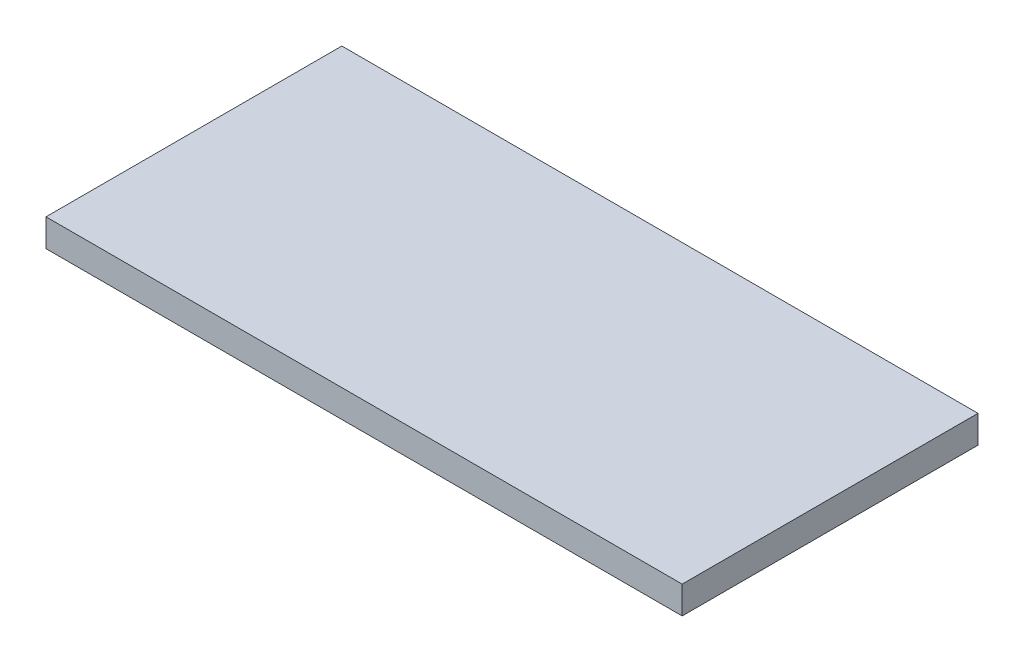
ISO-10303-21;
HEADER;
FILE_DESCRIPTION(('STEP AP214'),'2;1');
FILE_NAME('part.step','',(''),(''),'','','');
FILE_SCHEMA(('AUTOMOTIVE_DESIGN { 1 0 10303 214 1 1 1 1 }'));
ENDSEC;
DATA;
#1=APPLICATION_CONTEXT('core data for automotive mechanical design processes');
#2=APPLICATION_PROTOCOL_DEFINITION('international standard','automotive_design',2000,#1);
#3=PRODUCT_CONTEXT('',#1,'mechanical');
#4=PRODUCT('Part','Part','',(#3));
#5=PRODUCT_RELATED_PRODUCT_CATEGORY('part','',(#4));
#6=PRODUCT_DEFINITION_FORMATION('','',#4);
#7=PRODUCT_DEFINITION_CONTEXT('part definition',#1,'design');
#8=PRODUCT_DEFINITION('design','',#6,#7);
#9=PRODUCT_DEFINITION_SHAPE('','',#8);
#10=(LENGTH_UNIT() NAMED_UNIT(*) SI_UNIT(.MILLI.,.METRE.));
#11=(NAMED_UNIT(*) PLANE_ANGLE_UNIT() SI_UNIT($,.RADIAN.));
#12=(NAMED_UNIT(*) SI_UNIT($,.STERADIAN.) SOLID_ANGLE_UNIT());
#13=UNCERTAINTY_MEASURE_WITH_UNIT(LENGTH_MEASURE(1.E-05),#10,'distance_accuracy_value','');
#14=(GEOMETRIC_REPRESENTATION_CONTEXT(3) GLOBAL_UNCERTAINTY_ASSIGNED_CONTEXT((#13)) GLOBAL_UNIT_ASSIGNED_CONTEXT((#10,
#11,#12)) REPRESENTATION_CONTEXT('',''));
#15=CARTESIAN_POINT('',(0.,0.,0.));
#16=DIRECTION('',(0.,0.,1.));
#17=DIRECTION('',(1.,0.,0.));
#18=AXIS2_PLACEMENT_3D('',#15,#16,#17);
#19=CARTESIAN_POINT('',(-34.56399697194,3.,-16.0727414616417));
#20=DIRECTION('',(1.,0.,0.));
#21=DIRECTION('',(0.,0.,-1.));
#22=AXIS2_PLACEMENT_3D('',#19,#20,#21);
#23=PLANE('',#22);
#24=DIRECTION('',(0.,0.,1.));
#25=VECTOR('',#24,1.);
#26=CARTESIAN_POINT('',(-34.56399697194,0.,-16.0727414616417));
#27=LINE('',#26,#25);
#28=CARTESIAN_POINT('',(-34.56399697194,0.,-16.0727414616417));
#29=VERTEX_POINT('',#28);
#30=CARTESIAN_POINT('',(-34.56399697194,0.,16.0727414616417));
#31=VERTEX_POINT('',#30);
#32=EDGE_CURVE('E96',#29,#31,#27,.T.);
#33=ORIENTED_EDGE('',*,*,#32,.T.);
#34=DIRECTION('',(0.,-1.,0.));
#35=VECTOR('',#34,1.);
#36=CARTESIAN_POINT('',(-34.56399697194,3.,16.0727414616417));
#37=LINE('',#36,#35);
#38=CARTESIAN_POINT('',(-34.56399697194,3.,16.0727414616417));
#39=VERTEX_POINT('',#38);
#40=EDGE_CURVE('E11',#39,#31,#37,.T.);
#41=ORIENTED_EDGE('',*,*,#40,.F.);
#42=DIRECTION('',(0.,0.,1.));
#43=VECTOR('',#42,1.);
#44=CARTESIAN_POINT('',(-34.56399697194,3.,-16.0727414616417));
#45=LINE('',#44,#43);
#46=CARTESIAN_POINT('',(-34.56399697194,3.,-16.0727414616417));
#47=VERTEX_POINT('',#46);
#48=EDGE_CURVE('E84',#47,#39,#45,.T.);
#49=ORIENTED_EDGE('',*,*,#48,.F.);
#50=DIRECTION('',(0.,-1.,0.));
#51=VECTOR('',#50,1.);
#52=CARTESIAN_POINT('',(-34.56399697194,3.,-16.0727414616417));
#53=LINE('',#52,#51);
#54=EDGE_CURVE('E92',#47,#29,#53,.T.);
#55=ORIENTED_EDGE('',*,*,#54,.T.);
#56=EDGE_LOOP('',(#33,#41,#49,#55));
#57=FACE_BOUND('',#56,.T.);
#58=ADVANCED_FACE('F33',(#57),#23,.F.);
#59=CARTESIAN_POINT('',(-34.56399697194,3.,16.0727414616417));
#60=DIRECTION('',(0.,0.,-1.));
#61=DIRECTION('',(-1.,0.,0.));
#62=AXIS2_PLACEMENT_3D('',#59,#60,#61);
#63=PLANE('',#62);
#64=DIRECTION('',(1.,0.,0.));
#65=VECTOR('',#64,1.);
#66=CARTESIAN_POINT('',(-34.56399697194,0.,16.0727414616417));
#67=LINE('',#66,#65);
#68=CARTESIAN_POINT('',(34.56399697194,0.,16.0727414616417));
#69=VERTEX_POINT('',#68);
#70=EDGE_CURVE('E88',#31,#69,#67,.T.);
#71=ORIENTED_EDGE('',*,*,#70,.T.);
#72=DIRECTION('',(0.,-1.,0.));
#73=VECTOR('',#72,1.);
#74=CARTESIAN_POINT('',(34.56399697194,3.,16.0727414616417));
#75=LINE('',#74,#73);
#76=CARTESIAN_POINT('',(34.56399697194,3.,16.0727414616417));
#77=VERTEX_POINT('',#76);
#78=EDGE_CURVE('E41',#77,#69,#75,.T.);
#79=ORIENTED_EDGE('',*,*,#78,.F.);
#80=DIRECTION('',(1.,0.,0.));
#81=VECTOR('',#80,1.);
#82=CARTESIAN_POINT('',(-34.56399697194,3.,16.0727414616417));
#83=LINE('',#82,#81);
#84=EDGE_CURVE('E79',#39,#77,#83,.T.);
#85=ORIENTED_EDGE('',*,*,#84,.F.);
#86=ORIENTED_EDGE('',*,*,#40,.T.);
#87=EDGE_LOOP('',(#71,#79,#85,#86));
#88=FACE_BOUND('',#87,.T.);
#89=ADVANCED_FACE('F87',(#88),#63,.F.);
#90=CARTESIAN_POINT('',(34.56399697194,3.,-16.0727414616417));
#91=DIRECTION('',(-1.,0.,0.));
#92=DIRECTION('',(0.,0.,1.));
#93=AXIS2_PLACEMENT_3D('',#90,#91,#92);
#94=PLANE('',#93);
#95=DIRECTION('',(0.,0.,-1.));
#96=VECTOR('',#95,1.);
#97=CARTESIAN_POINT('',(34.56399697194,0.,-16.0727414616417));
#98=LINE('',#97,#96);
#99=CARTESIAN_POINT('',(34.56399697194,0.,-16.0727414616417));
#100=VERTEX_POINT('',#99);
#101=EDGE_CURVE('E66',#69,#100,#98,.T.);
#102=ORIENTED_EDGE('',*,*,#101,.T.);
#103=DIRECTION('',(0.,-1.,0.));
#104=VECTOR('',#103,1.);
#105=CARTESIAN_POINT('',(34.56399697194,3.,-16.0727414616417));
#106=LINE('',#105,#104);
#107=CARTESIAN_POINT('',(34.56399697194,3.,-16.0727414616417));
#108=VERTEX_POINT('',#107);
#109=EDGE_CURVE('E89',#108,#100,#106,.T.);
#110=ORIENTED_EDGE('',*,*,#109,.F.);
#111=DIRECTION('',(0.,0.,-1.));
#112=VECTOR('',#111,1.);
#113=CARTESIAN_POINT('',(34.56399697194,3.,-16.0727414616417));
#114=LINE('',#113,#112);
#115=EDGE_CURVE('E82',#77,#108,#114,.T.);
#116=ORIENTED_EDGE('',*,*,#115,.F.);
#117=ORIENTED_EDGE('',*,*,#78,.T.);
#118=EDGE_LOOP('',(#102,#110,#116,#117));
#119=FACE_BOUND('',#118,.T.);
#120=ADVANCED_FACE('F90',(#119),#94,.F.);
#121=CARTESIAN_POINT('',(-34.56399697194,3.,-16.0727414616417));
#122=DIRECTION('',(0.,0.,1.));
#123=DIRECTION('',(1.,0.,0.));
#124=AXIS2_PLACEMENT_3D('',#121,#122,#123);
#125=PLANE('',#124);
#126=DIRECTION('',(-1.,0.,0.));
#127=VECTOR('',#126,1.);
#128=CARTESIAN_POINT('',(-34.56399697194,0.,-16.0727414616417));
#129=LINE('',#128,#127);
#130=EDGE_CURVE('E72',#100,#29,#129,.T.);
#131=ORIENTED_EDGE('',*,*,#130,.T.);
#132=ORIENTED_EDGE('',*,*,#54,.F.);
#133=DIRECTION('',(-1.,0.,0.));
#134=VECTOR('',#133,1.);
#135=CARTESIAN_POINT('',(-34.56399697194,3.,-16.0727414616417));
#136=LINE('',#135,#134);
#137=EDGE_CURVE('E49',#108,#47,#136,.T.);
#138=ORIENTED_EDGE('',*,*,#137,.F.);
#139=ORIENTED_EDGE('',*,*,#109,.T.);
#140=EDGE_LOOP('',(#131,#132,#138,#139));
#141=FACE_BOUND('',#140,.T.);
#142=ADVANCED_FACE('F103',(#141),#125,.F.);
#143=CARTESIAN_POINT('',(-34.56399697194,3.,16.0727414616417));
#144=DIRECTION('',(0.,1.,0.));
#145=DIRECTION('',(0.,0.,1.));
#146=AXIS2_PLACEMENT_3D('',#143,#144,#145);
#147=PLANE('',#146);
#148=ORIENTED_EDGE('',*,*,#48,.T.);
#149=ORIENTED_EDGE('',*,*,#84,.T.);
#150=ORIENTED_EDGE('',*,*,#115,.T.);
#151=ORIENTED_EDGE('',*,*,#137,.T.);
#152=EDGE_LOOP('',(#148,#149,#150,#151));
#153=FACE_BOUND('',#152,.T.);
#154=ADVANCED_FACE('F80',(#153),#147,.T.);
#155=CARTESIAN_POINT('',(-34.56399697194,0.,16.0727414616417));
#156=DIRECTION('',(0.,1.,0.));
#157=DIRECTION('',(0.,0.,1.));
#158=AXIS2_PLACEMENT_3D('',#155,#156,#157);
#159=PLANE('',#158);
#160=ORIENTED_EDGE('',*,*,#32,.F.);
#161=ORIENTED_EDGE('',*,*,#130,.F.);
#162=ORIENTED_EDGE('',*,*,#101,.F.);
#163=ORIENTED_EDGE('',*,*,#70,.F.);
#164=EDGE_LOOP('',(#160,#161,#162,#163));
#165=FACE_BOUND('',#164,.T.);
#166=ADVANCED_FACE('F106',(#165),#159,.F.);
#167=CLOSED_SHELL('',(#58,#89,#120,#142,#154,#166));
#168=MANIFOLD_SOLID_BREP('B2',#167);
#169=ADVANCED_BREP_SHAPE_REPRESENTATION('',(#18,#168),#14);
#170=SHAPE_DEFINITION_REPRESENTATION(#9,#169);
ENDSEC;
END-ISO-10303-21;
